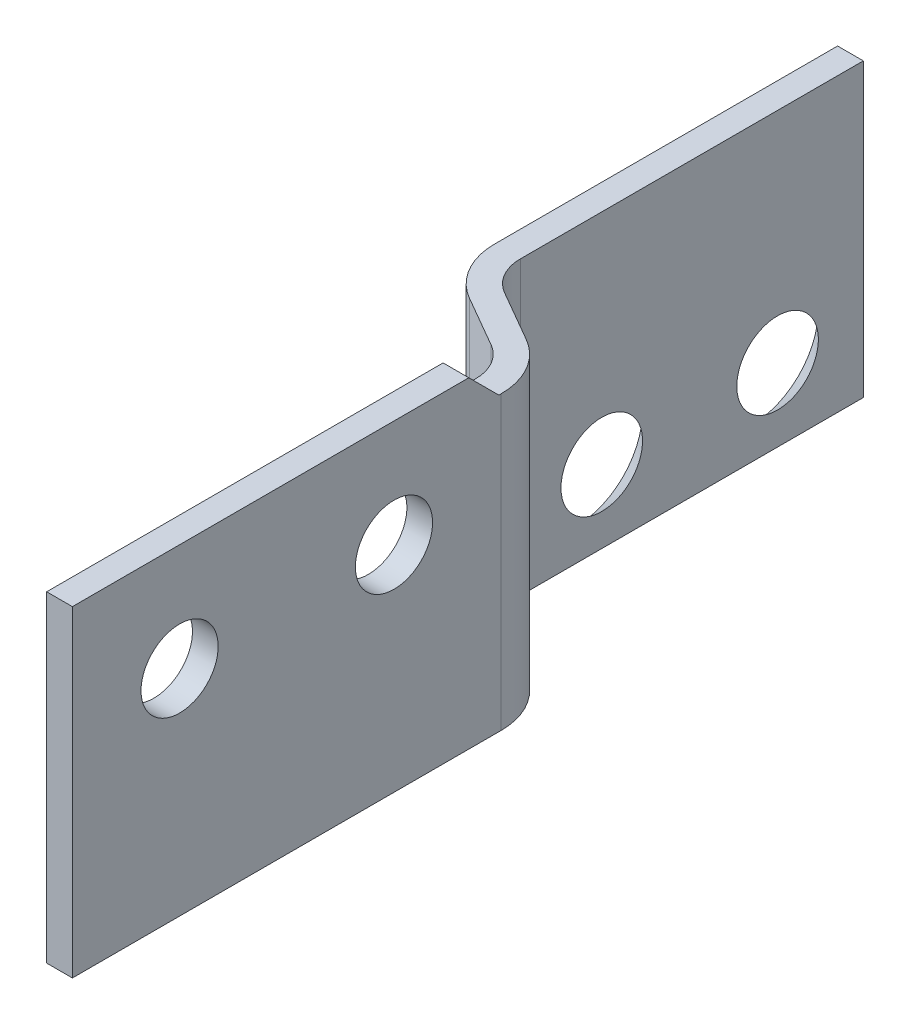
ISO-10303-21;
HEADER;
FILE_DESCRIPTION(('STEP AP214'),'2;1');
FILE_NAME('part.step','',(''),(''),'','','');
FILE_SCHEMA(('AUTOMOTIVE_DESIGN { 1 0 10303 214 1 1 1 1 }'));
ENDSEC;
DATA;
#1=APPLICATION_CONTEXT('core data for automotive mechanical design processes');
#2=APPLICATION_PROTOCOL_DEFINITION('international standard','automotive_design',2000,#1);
#3=PRODUCT_CONTEXT('',#1,'mechanical');
#4=PRODUCT('Part','Part','',(#3));
#5=PRODUCT_RELATED_PRODUCT_CATEGORY('part','',(#4));
#6=PRODUCT_DEFINITION_FORMATION('','',#4);
#7=PRODUCT_DEFINITION_CONTEXT('part definition',#1,'design');
#8=PRODUCT_DEFINITION('design','',#6,#7);
#9=PRODUCT_DEFINITION_SHAPE('','',#8);
#10=(LENGTH_UNIT() NAMED_UNIT(*) SI_UNIT(.MILLI.,.METRE.));
#11=(NAMED_UNIT(*) PLANE_ANGLE_UNIT() SI_UNIT($,.RADIAN.));
#12=(NAMED_UNIT(*) SI_UNIT($,.STERADIAN.) SOLID_ANGLE_UNIT());
#13=UNCERTAINTY_MEASURE_WITH_UNIT(LENGTH_MEASURE(1.E-05),#10,'distance_accuracy_value','');
#14=(GEOMETRIC_REPRESENTATION_CONTEXT(3) GLOBAL_UNCERTAINTY_ASSIGNED_CONTEXT((#13)) GLOBAL_UNIT_ASSIGNED_CONTEXT((#10,
#11,#12)) REPRESENTATION_CONTEXT('',''));
#15=CARTESIAN_POINT('',(0.,0.,0.));
#16=DIRECTION('',(0.,0.,1.));
#17=DIRECTION('',(1.,0.,0.));
#18=AXIS2_PLACEMENT_3D('',#15,#16,#17);
#19=CARTESIAN_POINT('',(2.,0.,10.07846096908));
#20=DIRECTION('',(-0.500000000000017,0.,0.866025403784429));
#21=DIRECTION('',(0.866025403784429,0.,0.500000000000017));
#22=AXIS2_PLACEMENT_3D('',#19,#20,#21);
#23=PLANE('',#22);
#24=DIRECTION('',(0.866025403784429,0.,0.500000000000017));
#25=VECTOR('',#24,1.);
#26=CARTESIAN_POINT('',(2.,0.,10.07846096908));
#27=LINE('',#26,#25);
#28=CARTESIAN_POINT('',(0.800000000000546,0.,9.38564064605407));
#29=VERTEX_POINT('',#28);
#30=CARTESIAN_POINT('',(2.00000000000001,0.,10.0784609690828));
#31=VERTEX_POINT('',#30);
#32=EDGE_CURVE('E198',#29,#31,#27,.T.);
#33=ORIENTED_EDGE('',*,*,#32,.T.);
#34=DIRECTION('',(0.,-1.,0.));
#35=VECTOR('',#34,1.);
#36=CARTESIAN_POINT('',(1.99999999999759,0.,10.0784609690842));
#37=LINE('',#36,#35);
#38=CARTESIAN_POINT('',(1.99999999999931,6.8,10.0784609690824));
#39=VERTEX_POINT('',#38);
#40=EDGE_CURVE('E183',#31,#39,#37,.F.);
#41=ORIENTED_EDGE('',*,*,#40,.T.);
#42=DIRECTION('',(-0.866025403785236,0.,-0.499999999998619));
#43=VECTOR('',#42,1.);
#44=CARTESIAN_POINT('',(2.,6.8,10.07846096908));
#45=LINE('',#44,#43);
#46=CARTESIAN_POINT('',(0.800000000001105,6.8,9.38564064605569));
#47=VERTEX_POINT('',#46);
#48=EDGE_CURVE('E146',#39,#47,#45,.T.);
#49=ORIENTED_EDGE('',*,*,#48,.T.);
#50=DIRECTION('',(0.,-1.,0.));
#51=VECTOR('',#50,1.);
#52=CARTESIAN_POINT('',(0.799999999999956,0.,9.38564064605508));
#53=LINE('',#52,#51);
#54=EDGE_CURVE('E150',#29,#47,#53,.F.);
#55=ORIENTED_EDGE('',*,*,#54,.F.);
#56=EDGE_LOOP('',(#33,#41,#49,#55));
#57=FACE_BOUND('',#56,.T.);
#58=ADVANCED_FACE('F17',(#57),#23,.T.);
#59=CARTESIAN_POINT('',(1.6,0.,8.));
#60=DIRECTION('',(0.,-1.,0.));
#61=DIRECTION('',(0.,0.,-1.));
#62=AXIS2_PLACEMENT_3D('',#59,#60,#61);
#63=CYLINDRICAL_SURFACE('',#62,1.6);
#64=CARTESIAN_POINT('',(1.6,0.,8.));
#65=DIRECTION('',(0.,-1.,0.));
#66=DIRECTION('',(0.,0.,-1.));
#67=AXIS2_PLACEMENT_3D('',#64,#65,#66);
#68=CIRCLE('',#67,1.6);
#69=CARTESIAN_POINT('',(0.,0.,8.));
#70=VERTEX_POINT('',#69);
#71=EDGE_CURVE('E20',#70,#29,#68,.F.);
#72=ORIENTED_EDGE('',*,*,#71,.T.);
#73=ORIENTED_EDGE('',*,*,#54,.T.);
#74=CARTESIAN_POINT('',(1.6,6.8,8.));
#75=DIRECTION('',(0.,-1.,0.));
#76=DIRECTION('',(0.,0.,-1.));
#77=AXIS2_PLACEMENT_3D('',#74,#75,#76);
#78=CIRCLE('',#77,1.6);
#79=CARTESIAN_POINT('',(0.,6.8,8.));
#80=VERTEX_POINT('',#79);
#81=EDGE_CURVE('E190',#47,#80,#78,.T.);
#82=ORIENTED_EDGE('',*,*,#81,.T.);
#83=DIRECTION('',(0.,1.,0.));
#84=VECTOR('',#83,1.);
#85=CARTESIAN_POINT('',(0.,0.,8.));
#86=LINE('',#85,#84);
#87=EDGE_CURVE('E179',#70,#80,#86,.T.);
#88=ORIENTED_EDGE('',*,*,#87,.F.);
#89=EDGE_LOOP('',(#72,#73,#82,#88));
#90=FACE_BOUND('',#89,.T.);
#91=ADVANCED_FACE('F330',(#90),#63,.T.);
#92=CARTESIAN_POINT('',(0.,6.8,0.));
#93=DIRECTION('',(0.,-1.,0.));
#94=DIRECTION('',(0.,0.,-1.));
#95=AXIS2_PLACEMENT_3D('',#92,#93,#94);
#96=PLANE('',#95);
#97=CARTESIAN_POINT('',(1.6,6.8,8.));
#98=DIRECTION('',(0.,-1.,0.));
#99=DIRECTION('',(0.,0.,-1.));
#100=AXIS2_PLACEMENT_3D('',#97,#98,#99);
#101=CIRCLE('',#100,1.);
#102=CARTESIAN_POINT('',(1.09999999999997,6.8,8.86602540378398));
#103=VERTEX_POINT('',#102);
#104=CARTESIAN_POINT('',(0.6,6.8,8.));
#105=VERTEX_POINT('',#104);
#106=EDGE_CURVE('E186',#103,#105,#101,.T.);
#107=ORIENTED_EDGE('',*,*,#106,.T.);
#108=DIRECTION('',(0.,0.,-1.));
#109=VECTOR('',#108,1.);
#110=CARTESIAN_POINT('',(0.6,6.8,0.));
#111=LINE('',#110,#109);
#112=CARTESIAN_POINT('',(0.6,6.8,0.));
#113=VERTEX_POINT('',#112);
#114=EDGE_CURVE('E175',#113,#105,#111,.F.);
#115=ORIENTED_EDGE('',*,*,#114,.F.);
#116=DIRECTION('',(-1.,0.,0.));
#117=VECTOR('',#116,1.);
#118=CARTESIAN_POINT('',(0.,6.8,0.));
#119=LINE('',#118,#117);
#120=CARTESIAN_POINT('',(0.,6.8,0.));
#121=VERTEX_POINT('',#120);
#122=EDGE_CURVE('E215',#121,#113,#119,.F.);
#123=ORIENTED_EDGE('',*,*,#122,.F.);
#124=DIRECTION('',(0.,0.,1.));
#125=VECTOR('',#124,1.);
#126=CARTESIAN_POINT('',(0.,6.8,8.));
#127=LINE('',#126,#125);
#128=EDGE_CURVE('E182',#80,#121,#127,.F.);
#129=ORIENTED_EDGE('',*,*,#128,.F.);
#130=ORIENTED_EDGE('',*,*,#81,.F.);
#131=ORIENTED_EDGE('',*,*,#48,.F.);
#132=CARTESIAN_POINT('',(1.5,6.8,10.94448637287));
#133=DIRECTION('',(0.,-1.,0.));
#134=DIRECTION('',(0.,0.,-1.));
#135=AXIS2_PLACEMENT_3D('',#132,#133,#134);
#136=CIRCLE('',#135,1.);
#137=CARTESIAN_POINT('',(2.5,6.8,10.94448637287));
#138=VERTEX_POINT('',#137);
#139=EDGE_CURVE('E180',#39,#138,#136,.T.);
#140=ORIENTED_EDGE('',*,*,#139,.T.);
#141=DIRECTION('',(0.,0.,-1.));
#142=VECTOR('',#141,1.);
#143=CARTESIAN_POINT('',(2.5,6.8,0.));
#144=LINE('',#143,#142);
#145=CARTESIAN_POINT('',(2.5,6.8,11.));
#146=VERTEX_POINT('',#145);
#147=EDGE_CURVE('E144',#146,#138,#144,.T.);
#148=ORIENTED_EDGE('',*,*,#147,.F.);
#149=DIRECTION('',(1.,0.,0.));
#150=VECTOR('',#149,1.);
#151=CARTESIAN_POINT('',(0.,6.8,11.));
#152=LINE('',#151,#150);
#153=CARTESIAN_POINT('',(3.1,6.8,11.));
#154=VERTEX_POINT('',#153);
#155=EDGE_CURVE('E116',#154,#146,#152,.F.);
#156=ORIENTED_EDGE('',*,*,#155,.F.);
#157=DIRECTION('',(0.,0.,-1.));
#158=VECTOR('',#157,1.);
#159=CARTESIAN_POINT('',(3.1,6.8,0.));
#160=LINE('',#159,#158);
#161=CARTESIAN_POINT('',(3.1,6.8,10.94448637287));
#162=VERTEX_POINT('',#161);
#163=EDGE_CURVE('E123',#162,#154,#160,.F.);
#164=ORIENTED_EDGE('',*,*,#163,.F.);
#165=CARTESIAN_POINT('',(1.5,6.8,10.94448637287));
#166=DIRECTION('',(0.,-1.,0.));
#167=DIRECTION('',(0.,0.,-1.));
#168=AXIS2_PLACEMENT_3D('',#165,#166,#167);
#169=CIRCLE('',#168,1.6);
#170=CARTESIAN_POINT('',(2.3000000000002,6.8,9.55884572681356));
#171=VERTEX_POINT('',#170);
#172=EDGE_CURVE('E131',#171,#162,#169,.T.);
#173=ORIENTED_EDGE('',*,*,#172,.F.);
#174=DIRECTION('',(0.866025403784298,0.,0.500000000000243));
#175=VECTOR('',#174,1.);
#176=CARTESIAN_POINT('',(1.1,6.8,8.866025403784));
#177=LINE('',#176,#175);
#178=EDGE_CURVE('E191',#103,#171,#177,.T.);
#179=ORIENTED_EDGE('',*,*,#178,.F.);
#180=EDGE_LOOP('',(#107,#115,#123,#129,#130,#131,#140,#148,#156,#164,#173,#179));
#181=FACE_BOUND('',#180,.T.);
#182=ADVANCED_FACE('F142',(#181),#96,.F.);
#183=CARTESIAN_POINT('',(0.,0.,0.));
#184=DIRECTION('',(0.,0.,-1.));
#185=DIRECTION('',(-1.,0.,0.));
#186=AXIS2_PLACEMENT_3D('',#183,#184,#185);
#187=PLANE('',#186);
#188=DIRECTION('',(-1.,0.,0.));
#189=VECTOR('',#188,1.);
#190=CARTESIAN_POINT('',(0.,0.,0.));
#191=LINE('',#190,#189);
#192=CARTESIAN_POINT('',(0.6,0.,0.));
#193=VERTEX_POINT('',#192);
#194=CARTESIAN_POINT('',(0.,0.,0.));
#195=VERTEX_POINT('',#194);
#196=EDGE_CURVE('E102',#193,#195,#191,.T.);
#197=ORIENTED_EDGE('',*,*,#196,.T.);
#198=DIRECTION('',(0.,1.,0.));
#199=VECTOR('',#198,1.);
#200=CARTESIAN_POINT('',(0.,0.,0.));
#201=LINE('',#200,#199);
#202=EDGE_CURVE('E208',#121,#195,#201,.F.);
#203=ORIENTED_EDGE('',*,*,#202,.F.);
#204=ORIENTED_EDGE('',*,*,#122,.T.);
#205=DIRECTION('',(0.,1.,0.));
#206=VECTOR('',#205,1.);
#207=CARTESIAN_POINT('',(0.6,0.,0.));
#208=LINE('',#207,#206);
#209=EDGE_CURVE('E171',#193,#113,#208,.T.);
#210=ORIENTED_EDGE('',*,*,#209,.F.);
#211=EDGE_LOOP('',(#197,#203,#204,#210));
#212=FACE_BOUND('',#211,.T.);
#213=ADVANCED_FACE('F334',(#212),#187,.T.);
#214=CARTESIAN_POINT('',(5.6843418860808E-11,1.7,2.));
#215=DIRECTION('',(-1.,0.,0.));
#216=DIRECTION('',(0.,0.,1.));
#217=AXIS2_PLACEMENT_3D('',#214,#215,#216);
#218=CONICAL_SURFACE('',#217,1.55179693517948,0.78597748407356);
#219=CARTESIAN_POINT('',(-5.6711556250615E-11,1.7,2.));
#220=DIRECTION('',(-1.,0.,0.));
#221=DIRECTION('',(0.,0.,1.));
#222=AXIS2_PLACEMENT_3D('',#219,#220,#221);
#223=CIRCLE('',#222,1.55179693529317);
#224=CARTESIAN_POINT('',(-5.6711556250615E-11,1.7,3.55179693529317));
#225=VERTEX_POINT('',#224);
#226=EDGE_CURVE('E176',#225,#225,#223,.F.);
#227=ORIENTED_EDGE('',*,*,#226,.F.);
#228=EDGE_LOOP('',(#227));
#229=FACE_BOUND('',#228,.T.);
#230=CARTESIAN_POINT('',(0.59999999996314,1.7,2.));
#231=DIRECTION('',(-1.,0.,0.));
#232=DIRECTION('',(0.,0.,1.));
#233=AXIS2_PLACEMENT_3D('',#230,#231,#232);
#234=CIRCLE('',#233,0.951101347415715);
#235=CARTESIAN_POINT('',(0.59999999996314,1.7,2.95110134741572));
#236=VERTEX_POINT('',#235);
#237=EDGE_CURVE('E168',#236,#236,#234,.T.);
#238=ORIENTED_EDGE('',*,*,#237,.F.);
#239=EDGE_LOOP('',(#238));
#240=FACE_BOUND('',#239,.T.);
#241=ADVANCED_FACE('F336',(#229,#240),#218,.F.);
#242=CARTESIAN_POINT('',(1.70530256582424E-10,1.7,6.1));
#243=DIRECTION('',(-1.,0.,0.));
#244=DIRECTION('',(0.,0.,1.));
#245=AXIS2_PLACEMENT_3D('',#242,#243,#244);
#246=CONICAL_SURFACE('',#245,1.55179693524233,0.78597748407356);
#247=CARTESIAN_POINT('',(5.6975281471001E-11,1.7,6.1));
#248=DIRECTION('',(-1.,0.,0.));
#249=DIRECTION('',(0.,0.,1.));
#250=AXIS2_PLACEMENT_3D('',#247,#248,#249);
#251=CIRCLE('',#250,1.55179693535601);
#252=CARTESIAN_POINT('',(5.6975281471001E-11,1.7,7.65179693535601));
#253=VERTEX_POINT('',#252);
#254=EDGE_CURVE('E172',#253,#253,#251,.F.);
#255=ORIENTED_EDGE('',*,*,#254,.F.);
#256=EDGE_LOOP('',(#255));
#257=FACE_BOUND('',#256,.T.);
#258=CARTESIAN_POINT('',(0.600000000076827,1.7,6.1));
#259=DIRECTION('',(-1.,0.,0.));
#260=DIRECTION('',(0.,0.,1.));
#261=AXIS2_PLACEMENT_3D('',#258,#259,#260);
#262=CIRCLE('',#261,0.951101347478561);
#263=CARTESIAN_POINT('',(0.600000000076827,1.7,7.05110134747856));
#264=VERTEX_POINT('',#263);
#265=EDGE_CURVE('E164',#264,#264,#262,.T.);
#266=ORIENTED_EDGE('',*,*,#265,.F.);
#267=EDGE_LOOP('',(#266));
#268=FACE_BOUND('',#267,.T.);
#269=ADVANCED_FACE('F343',(#257,#268),#246,.F.);
#270=CARTESIAN_POINT('',(1.6,0.,8.));
#271=DIRECTION('',(0.,-1.,0.));
#272=DIRECTION('',(0.,0.,-1.));
#273=AXIS2_PLACEMENT_3D('',#270,#271,#272);
#274=CYLINDRICAL_SURFACE('',#273,1.);
#275=DIRECTION('',(0.,1.,0.));
#276=VECTOR('',#275,1.);
#277=CARTESIAN_POINT('',(1.1,0.,8.866025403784));
#278=LINE('',#277,#276);
#279=CARTESIAN_POINT('',(1.09999999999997,0.,8.86602540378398));
#280=VERTEX_POINT('',#279);
#281=EDGE_CURVE('E167',#280,#103,#278,.T.);
#282=ORIENTED_EDGE('',*,*,#281,.F.);
#283=CARTESIAN_POINT('',(1.6,0.,8.));
#284=DIRECTION('',(0.,-1.,0.));
#285=DIRECTION('',(0.,0.,-1.));
#286=AXIS2_PLACEMENT_3D('',#283,#284,#285);
#287=CIRCLE('',#286,1.);
#288=CARTESIAN_POINT('',(0.6,0.,8.));
#289=VERTEX_POINT('',#288);
#290=EDGE_CURVE('E188',#289,#280,#287,.F.);
#291=ORIENTED_EDGE('',*,*,#290,.F.);
#292=DIRECTION('',(0.,1.,0.));
#293=VECTOR('',#292,1.);
#294=CARTESIAN_POINT('',(0.6,0.,8.));
#295=LINE('',#294,#293);
#296=EDGE_CURVE('E220',#105,#289,#295,.F.);
#297=ORIENTED_EDGE('',*,*,#296,.F.);
#298=ORIENTED_EDGE('',*,*,#106,.F.);
#299=EDGE_LOOP('',(#282,#291,#297,#298));
#300=FACE_BOUND('',#299,.T.);
#301=ADVANCED_FACE('F309',(#300),#274,.F.);
#302=CARTESIAN_POINT('',(1.5,0.,10.94448637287));
#303=DIRECTION('',(0.,-1.,0.));
#304=DIRECTION('',(0.,0.,-1.));
#305=AXIS2_PLACEMENT_3D('',#302,#303,#304);
#306=CYLINDRICAL_SURFACE('',#305,1.);
#307=ORIENTED_EDGE('',*,*,#40,.F.);
#308=CARTESIAN_POINT('',(1.5,0.,10.94448637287));
#309=DIRECTION('',(0.,-1.,0.));
#310=DIRECTION('',(0.,0.,-1.));
#311=AXIS2_PLACEMENT_3D('',#308,#309,#310);
#312=CIRCLE('',#311,1.);
#313=CARTESIAN_POINT('',(2.5,0.,10.94448637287));
#314=VERTEX_POINT('',#313);
#315=EDGE_CURVE('E184',#314,#31,#312,.F.);
#316=ORIENTED_EDGE('',*,*,#315,.F.);
#317=DIRECTION('',(0.,1.,0.));
#318=VECTOR('',#317,1.);
#319=CARTESIAN_POINT('',(2.5,0.,10.94448637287));
#320=LINE('',#319,#318);
#321=EDGE_CURVE('E233',#138,#314,#320,.F.);
#322=ORIENTED_EDGE('',*,*,#321,.F.);
#323=ORIENTED_EDGE('',*,*,#139,.F.);
#324=EDGE_LOOP('',(#307,#316,#322,#323));
#325=FACE_BOUND('',#324,.T.);
#326=ADVANCED_FACE('F327',(#325),#306,.F.);
#327=CARTESIAN_POINT('',(0.,0.,8.));
#328=DIRECTION('',(-1.,0.,0.));
#329=DIRECTION('',(0.,0.,1.));
#330=AXIS2_PLACEMENT_3D('',#327,#328,#329);
#331=PLANE('',#330);
#332=ORIENTED_EDGE('',*,*,#254,.T.);
#333=EDGE_LOOP('',(#332));
#334=FACE_BOUND('',#333,.T.);
#335=ORIENTED_EDGE('',*,*,#226,.T.);
#336=EDGE_LOOP('',(#335));
#337=FACE_BOUND('',#336,.T.);
#338=DIRECTION('',(0.,0.,-1.));
#339=VECTOR('',#338,1.);
#340=CARTESIAN_POINT('',(0.,0.,0.));
#341=LINE('',#340,#339);
#342=EDGE_CURVE('E294',#70,#195,#341,.T.);
#343=ORIENTED_EDGE('',*,*,#342,.F.);
#344=ORIENTED_EDGE('',*,*,#87,.T.);
#345=ORIENTED_EDGE('',*,*,#128,.T.);
#346=ORIENTED_EDGE('',*,*,#202,.T.);
#347=EDGE_LOOP('',(#343,#344,#345,#346));
#348=FACE_BOUND('',#347,.T.);
#349=ADVANCED_FACE('F333',(#334,#337,#348),#331,.T.);
#350=CARTESIAN_POINT('',(0.6,0.,0.));
#351=DIRECTION('',(1.,0.,0.));
#352=DIRECTION('',(0.,0.,-1.));
#353=AXIS2_PLACEMENT_3D('',#350,#351,#352);
#354=PLANE('',#353);
#355=ORIENTED_EDGE('',*,*,#265,.T.);
#356=EDGE_LOOP('',(#355));
#357=FACE_BOUND('',#356,.T.);
#358=ORIENTED_EDGE('',*,*,#237,.T.);
#359=EDGE_LOOP('',(#358));
#360=FACE_BOUND('',#359,.T.);
#361=DIRECTION('',(0.,0.,-1.));
#362=VECTOR('',#361,1.);
#363=CARTESIAN_POINT('',(0.6,0.,0.));
#364=LINE('',#363,#362);
#365=EDGE_CURVE('E163',#193,#289,#364,.F.);
#366=ORIENTED_EDGE('',*,*,#365,.F.);
#367=ORIENTED_EDGE('',*,*,#209,.T.);
#368=ORIENTED_EDGE('',*,*,#114,.T.);
#369=ORIENTED_EDGE('',*,*,#296,.T.);
#370=EDGE_LOOP('',(#366,#367,#368,#369));
#371=FACE_BOUND('',#370,.T.);
#372=ADVANCED_FACE('F305',(#357,#360,#371),#354,.T.);
#373=CARTESIAN_POINT('',(1.1,0.,8.866025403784));
#374=DIRECTION('',(0.500000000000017,0.,-0.866025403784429));
#375=DIRECTION('',(-0.866025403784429,0.,-0.500000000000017));
#376=AXIS2_PLACEMENT_3D('',#373,#374,#375);
#377=PLANE('',#376);
#378=DIRECTION('',(0.866025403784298,0.,0.500000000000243));
#379=VECTOR('',#378,1.);
#380=CARTESIAN_POINT('',(1.1,0.,8.866025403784));
#381=LINE('',#380,#379);
#382=CARTESIAN_POINT('',(2.3000000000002,0.,9.55884572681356));
#383=VERTEX_POINT('',#382);
#384=EDGE_CURVE('E245',#280,#383,#381,.T.);
#385=ORIENTED_EDGE('',*,*,#384,.F.);
#386=ORIENTED_EDGE('',*,*,#281,.T.);
#387=ORIENTED_EDGE('',*,*,#178,.T.);
#388=DIRECTION('',(0.,-1.,0.));
#389=VECTOR('',#388,1.);
#390=CARTESIAN_POINT('',(2.29999999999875,0.,9.55884572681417));
#391=LINE('',#390,#389);
#392=EDGE_CURVE('E161',#383,#171,#391,.F.);
#393=ORIENTED_EDGE('',*,*,#392,.F.);
#394=EDGE_LOOP('',(#385,#386,#387,#393));
#395=FACE_BOUND('',#394,.T.);
#396=ADVANCED_FACE('F313',(#395),#377,.T.);
#397=CARTESIAN_POINT('',(2.5,0.,20.94448637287));
#398=DIRECTION('',(-1.,0.,0.));
#399=DIRECTION('',(0.,0.,1.));
#400=AXIS2_PLACEMENT_3D('',#397,#398,#399);
#401=PLANE('',#400);
#402=CARTESIAN_POINT('',(2.5,5.,13.44448637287));
#403=DIRECTION('',(-1.,0.,0.));
#404=DIRECTION('',(0.,0.,1.));
#405=AXIS2_PLACEMENT_3D('',#402,#403,#404);
#406=CIRCLE('',#405,0.9);
#407=CARTESIAN_POINT('',(2.5,5.,14.34448637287));
#408=VERTEX_POINT('',#407);
#409=EDGE_CURVE('E139',#408,#408,#406,.F.);
#410=ORIENTED_EDGE('',*,*,#409,.T.);
#411=EDGE_LOOP('',(#410));
#412=FACE_BOUND('',#411,.T.);
#413=CARTESIAN_POINT('',(2.5,5.,18.44448637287));
#414=DIRECTION('',(-1.,0.,0.));
#415=DIRECTION('',(0.,0.,1.));
#416=AXIS2_PLACEMENT_3D('',#413,#414,#415);
#417=CIRCLE('',#416,0.9);
#418=CARTESIAN_POINT('',(2.5,5.,19.34448637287));
#419=VERTEX_POINT('',#418);
#420=EDGE_CURVE('E158',#419,#419,#417,.F.);
#421=ORIENTED_EDGE('',*,*,#420,.T.);
#422=EDGE_LOOP('',(#421));
#423=FACE_BOUND('',#422,.T.);
#424=DIRECTION('',(0.,0.,-1.));
#425=VECTOR('',#424,1.);
#426=CARTESIAN_POINT('',(2.5,7.5,11.7));
#427=LINE('',#426,#425);
#428=CARTESIAN_POINT('',(2.5,7.5,20.94448637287));
#429=VERTEX_POINT('',#428);
#430=CARTESIAN_POINT('',(2.5,7.5,11.7));
#431=VERTEX_POINT('',#430);
#432=EDGE_CURVE('E232',#429,#431,#427,.T.);
#433=ORIENTED_EDGE('',*,*,#432,.T.);
#434=DIRECTION('',(0.,-0.707106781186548,-0.707106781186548));
#435=VECTOR('',#434,1.);
#436=CARTESIAN_POINT('',(2.5,6.8,11.));
#437=LINE('',#436,#435);
#438=EDGE_CURVE('E230',#431,#146,#437,.T.);
#439=ORIENTED_EDGE('',*,*,#438,.T.);
#440=ORIENTED_EDGE('',*,*,#147,.T.);
#441=ORIENTED_EDGE('',*,*,#321,.T.);
#442=DIRECTION('',(0.,0.,-1.));
#443=VECTOR('',#442,1.);
#444=CARTESIAN_POINT('',(2.5,0.,0.));
#445=LINE('',#444,#443);
#446=CARTESIAN_POINT('',(2.5,0.,20.94448637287));
#447=VERTEX_POINT('',#446);
#448=EDGE_CURVE('E284',#447,#314,#445,.T.);
#449=ORIENTED_EDGE('',*,*,#448,.F.);
#450=DIRECTION('',(0.,1.,0.));
#451=VECTOR('',#450,1.);
#452=CARTESIAN_POINT('',(2.5,0.,20.94448637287));
#453=LINE('',#452,#451);
#454=EDGE_CURVE('E242',#429,#447,#453,.F.);
#455=ORIENTED_EDGE('',*,*,#454,.F.);
#456=EDGE_LOOP('',(#433,#439,#440,#441,#449,#455));
#457=FACE_BOUND('',#456,.T.);
#458=ADVANCED_FACE('F323',(#412,#423,#457),#401,.T.);
#459=CARTESIAN_POINT('',(0.,6.8,11.));
#460=DIRECTION('',(0.,-0.707106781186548,0.707106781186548));
#461=DIRECTION('',(0.,-0.707106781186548,-0.707106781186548));
#462=AXIS2_PLACEMENT_3D('',#459,#460,#461);
#463=PLANE('',#462);
#464=ORIENTED_EDGE('',*,*,#155,.T.);
#465=ORIENTED_EDGE('',*,*,#438,.F.);
#466=DIRECTION('',(1.,0.,0.));
#467=VECTOR('',#466,1.);
#468=CARTESIAN_POINT('',(0.,7.5,11.7));
#469=LINE('',#468,#467);
#470=CARTESIAN_POINT('',(3.1,7.5,11.7));
#471=VERTEX_POINT('',#470);
#472=EDGE_CURVE('E136',#431,#471,#469,.T.);
#473=ORIENTED_EDGE('',*,*,#472,.T.);
#474=DIRECTION('',(0.,0.707106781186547,0.707106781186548));
#475=VECTOR('',#474,1.);
#476=CARTESIAN_POINT('',(3.1,6.8,11.));
#477=LINE('',#476,#475);
#478=EDGE_CURVE('E127',#154,#471,#477,.T.);
#479=ORIENTED_EDGE('',*,*,#478,.F.);
#480=EDGE_LOOP('',(#464,#465,#473,#479));
#481=FACE_BOUND('',#480,.T.);
#482=ADVANCED_FACE('F134',(#481),#463,.F.);
#483=CARTESIAN_POINT('',(0.,7.5,11.7));
#484=DIRECTION('',(0.,-1.,0.));
#485=DIRECTION('',(0.,0.,-1.));
#486=AXIS2_PLACEMENT_3D('',#483,#484,#485);
#487=PLANE('',#486);
#488=ORIENTED_EDGE('',*,*,#472,.F.);
#489=ORIENTED_EDGE('',*,*,#432,.F.);
#490=DIRECTION('',(1.,0.,0.));
#491=VECTOR('',#490,1.);
#492=CARTESIAN_POINT('',(3.1,7.5,20.94448637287));
#493=LINE('',#492,#491);
#494=CARTESIAN_POINT('',(3.1,7.5,20.94448637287));
#495=VERTEX_POINT('',#494);
#496=EDGE_CURVE('E246',#495,#429,#493,.F.);
#497=ORIENTED_EDGE('',*,*,#496,.F.);
#498=DIRECTION('',(0.,0.,-1.));
#499=VECTOR('',#498,1.);
#500=CARTESIAN_POINT('',(3.1,7.5,10.94448637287));
#501=LINE('',#500,#499);
#502=EDGE_CURVE('E138',#471,#495,#501,.F.);
#503=ORIENTED_EDGE('',*,*,#502,.F.);
#504=EDGE_LOOP('',(#488,#489,#497,#503));
#505=FACE_BOUND('',#504,.T.);
#506=ADVANCED_FACE('F368',(#505),#487,.F.);
#507=CARTESIAN_POINT('',(3.1,0.,20.94448637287));
#508=DIRECTION('',(0.,0.,1.));
#509=DIRECTION('',(1.,0.,0.));
#510=AXIS2_PLACEMENT_3D('',#507,#508,#509);
#511=PLANE('',#510);
#512=DIRECTION('',(1.,0.,0.));
#513=VECTOR('',#512,1.);
#514=CARTESIAN_POINT('',(0.,0.,20.94448637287));
#515=LINE('',#514,#513);
#516=CARTESIAN_POINT('',(3.1,0.,20.94448637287));
#517=VERTEX_POINT('',#516);
#518=EDGE_CURVE('E281',#517,#447,#515,.F.);
#519=ORIENTED_EDGE('',*,*,#518,.F.);
#520=DIRECTION('',(0.,1.,0.));
#521=VECTOR('',#520,1.);
#522=CARTESIAN_POINT('',(3.1,0.,20.94448637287));
#523=LINE('',#522,#521);
#524=EDGE_CURVE('E269',#495,#517,#523,.F.);
#525=ORIENTED_EDGE('',*,*,#524,.F.);
#526=ORIENTED_EDGE('',*,*,#496,.T.);
#527=ORIENTED_EDGE('',*,*,#454,.T.);
#528=EDGE_LOOP('',(#519,#525,#526,#527));
#529=FACE_BOUND('',#528,.T.);
#530=ADVANCED_FACE('F319',(#529),#511,.T.);
#531=CARTESIAN_POINT('',(0.,0.,0.));
#532=DIRECTION('',(0.,-1.,0.));
#533=DIRECTION('',(0.,0.,-1.));
#534=AXIS2_PLACEMENT_3D('',#531,#532,#533);
#535=PLANE('',#534);
#536=ORIENTED_EDGE('',*,*,#365,.T.);
#537=ORIENTED_EDGE('',*,*,#290,.T.);
#538=ORIENTED_EDGE('',*,*,#384,.T.);
#539=CARTESIAN_POINT('',(1.5,0.,10.94448637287));
#540=DIRECTION('',(0.,-1.,0.));
#541=DIRECTION('',(0.,0.,-1.));
#542=AXIS2_PLACEMENT_3D('',#539,#540,#541);
#543=CIRCLE('',#542,1.6);
#544=CARTESIAN_POINT('',(3.1,0.,10.94448637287));
#545=VERTEX_POINT('',#544);
#546=EDGE_CURVE('E35',#545,#383,#543,.F.);
#547=ORIENTED_EDGE('',*,*,#546,.F.);
#548=DIRECTION('',(0.,0.,-1.));
#549=VECTOR('',#548,1.);
#550=CARTESIAN_POINT('',(3.1,0.,10.94448637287));
#551=LINE('',#550,#549);
#552=EDGE_CURVE('E278',#517,#545,#551,.T.);
#553=ORIENTED_EDGE('',*,*,#552,.F.);
#554=ORIENTED_EDGE('',*,*,#518,.T.);
#555=ORIENTED_EDGE('',*,*,#448,.T.);
#556=ORIENTED_EDGE('',*,*,#315,.T.);
#557=ORIENTED_EDGE('',*,*,#32,.F.);
#558=ORIENTED_EDGE('',*,*,#71,.F.);
#559=ORIENTED_EDGE('',*,*,#342,.T.);
#560=ORIENTED_EDGE('',*,*,#196,.F.);
#561=EDGE_LOOP('',(#536,#537,#538,#547,#553,#554,#555,#556,#557,#558,#559,#560));
#562=FACE_BOUND('',#561,.T.);
#563=ADVANCED_FACE('F302',(#562),#535,.T.);
#564=CARTESIAN_POINT('',(1.5,0.,10.94448637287));
#565=DIRECTION('',(0.,-1.,0.));
#566=DIRECTION('',(0.,0.,-1.));
#567=AXIS2_PLACEMENT_3D('',#564,#565,#566);
#568=CYLINDRICAL_SURFACE('',#567,1.6);
#569=ORIENTED_EDGE('',*,*,#546,.T.);
#570=ORIENTED_EDGE('',*,*,#392,.T.);
#571=ORIENTED_EDGE('',*,*,#172,.T.);
#572=DIRECTION('',(0.,1.,0.));
#573=VECTOR('',#572,1.);
#574=CARTESIAN_POINT('',(3.1,0.,10.94448637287));
#575=LINE('',#574,#573);
#576=EDGE_CURVE('E128',#545,#162,#575,.T.);
#577=ORIENTED_EDGE('',*,*,#576,.F.);
#578=EDGE_LOOP('',(#569,#570,#571,#577));
#579=FACE_BOUND('',#578,.T.);
#580=ADVANCED_FACE('F314',(#579),#568,.T.);
#581=CARTESIAN_POINT('',(2.5,5.,18.44448637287));
#582=DIRECTION('',(-1.,0.,0.));
#583=DIRECTION('',(0.,0.,1.));
#584=AXIS2_PLACEMENT_3D('',#581,#582,#583);
#585=CYLINDRICAL_SURFACE('',#584,0.9);
#586=ORIENTED_EDGE('',*,*,#420,.F.);
#587=EDGE_LOOP('',(#586));
#588=FACE_BOUND('',#587,.T.);
#589=CARTESIAN_POINT('',(3.1,5.,18.44448637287));
#590=DIRECTION('',(-1.,0.,0.));
#591=DIRECTION('',(0.,0.,1.));
#592=AXIS2_PLACEMENT_3D('',#589,#590,#591);
#593=CIRCLE('',#592,0.9);
#594=CARTESIAN_POINT('',(3.1,5.,19.34448637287));
#595=VERTEX_POINT('',#594);
#596=EDGE_CURVE('E26',#595,#595,#593,.T.);
#597=ORIENTED_EDGE('',*,*,#596,.F.);
#598=EDGE_LOOP('',(#597));
#599=FACE_BOUND('',#598,.T.);
#600=ADVANCED_FACE('F354',(#588,#599),#585,.F.);
#601=CARTESIAN_POINT('',(2.5,5.,13.44448637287));
#602=DIRECTION('',(-1.,0.,0.));
#603=DIRECTION('',(0.,0.,1.));
#604=AXIS2_PLACEMENT_3D('',#601,#602,#603);
#605=CYLINDRICAL_SURFACE('',#604,0.9);
#606=ORIENTED_EDGE('',*,*,#409,.F.);
#607=EDGE_LOOP('',(#606));
#608=FACE_BOUND('',#607,.T.);
#609=CARTESIAN_POINT('',(3.1,5.,13.44448637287));
#610=DIRECTION('',(-1.,0.,0.));
#611=DIRECTION('',(0.,0.,1.));
#612=AXIS2_PLACEMENT_3D('',#609,#610,#611);
#613=CIRCLE('',#612,0.9);
#614=CARTESIAN_POINT('',(3.1,5.,14.34448637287));
#615=VERTEX_POINT('',#614);
#616=EDGE_CURVE('E11',#615,#615,#613,.T.);
#617=ORIENTED_EDGE('',*,*,#616,.F.);
#618=EDGE_LOOP('',(#617));
#619=FACE_BOUND('',#618,.T.);
#620=ADVANCED_FACE('F348',(#608,#619),#605,.F.);
#621=CARTESIAN_POINT('',(3.1,0.,10.94448637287));
#622=DIRECTION('',(1.,0.,0.));
#623=DIRECTION('',(0.,0.,-1.));
#624=AXIS2_PLACEMENT_3D('',#621,#622,#623);
#625=PLANE('',#624);
#626=ORIENTED_EDGE('',*,*,#616,.T.);
#627=EDGE_LOOP('',(#626));
#628=FACE_BOUND('',#627,.T.);
#629=ORIENTED_EDGE('',*,*,#596,.T.);
#630=EDGE_LOOP('',(#629));
#631=FACE_BOUND('',#630,.T.);
#632=ORIENTED_EDGE('',*,*,#552,.T.);
#633=ORIENTED_EDGE('',*,*,#576,.T.);
#634=ORIENTED_EDGE('',*,*,#163,.T.);
#635=ORIENTED_EDGE('',*,*,#478,.T.);
#636=ORIENTED_EDGE('',*,*,#502,.T.);
#637=ORIENTED_EDGE('',*,*,#524,.T.);
#638=EDGE_LOOP('',(#632,#633,#634,#635,#636,#637));
#639=FACE_BOUND('',#638,.T.);
#640=ADVANCED_FACE('F125',(#628,#631,#639),#625,.T.);
#641=CLOSED_SHELL('',(#58,#91,#182,#213,#241,#269,#301,#326,#349,#372,#396,#458,#482,#506,#530,
#563,#580,#600,#620,#640));
#642=MANIFOLD_SOLID_BREP('B1',#641);
#643=ADVANCED_BREP_SHAPE_REPRESENTATION('',(#18,#642),#14);
#644=SHAPE_DEFINITION_REPRESENTATION(#9,#643);
ENDSEC;
END-ISO-10303-21;
